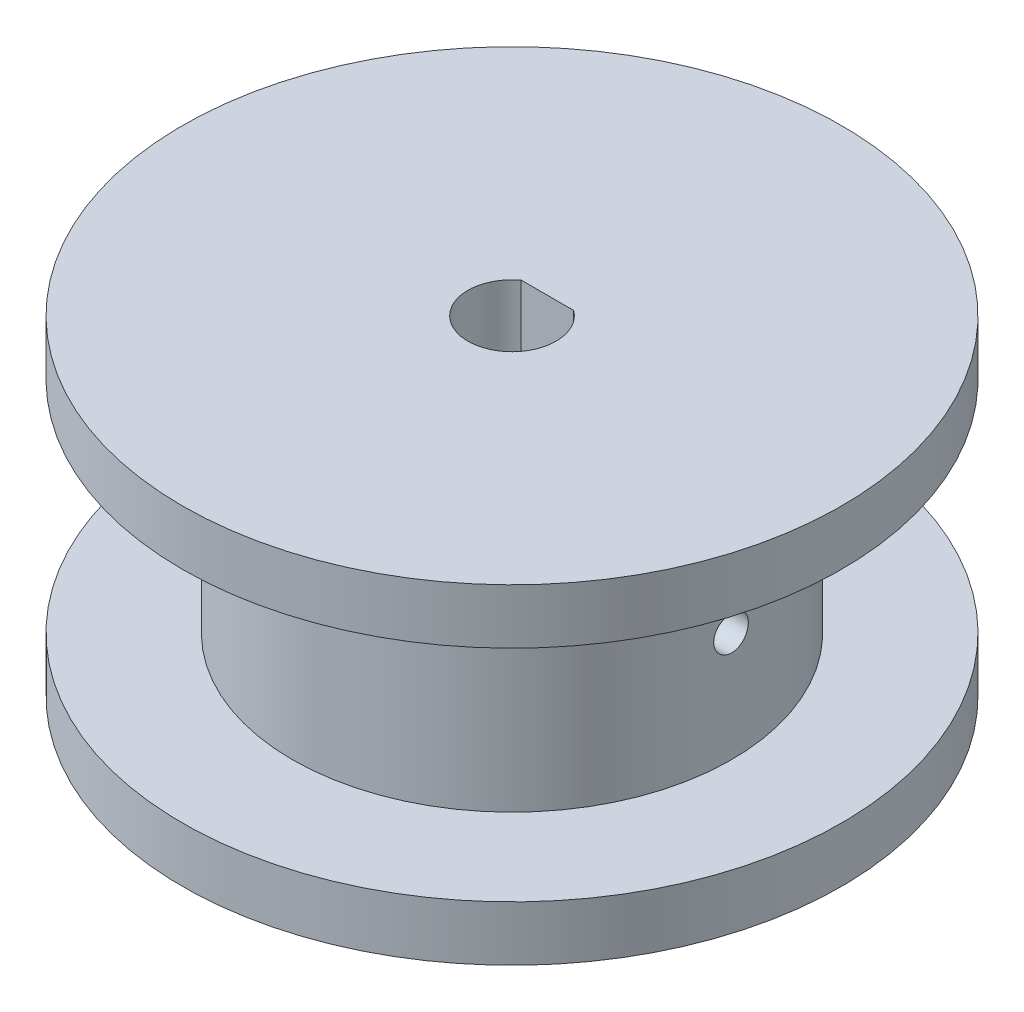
from build123d import *

# Parameters (mm, degrees)
SKETCH1_R               = 12.7
BOSS_EXTRUDE1_DEPTH     = 12.7
BOSS_EXTRUDE2_START     = 3.175
SKETCH2_R               = 19.05
BOSS_EXTRUDE2_DEPTH     = 3.175
BOSS_EXTRUDE3_START     = 6.35
SKETCH3_R               = 5.725
BOSS_EXTRUDE3_DEPTH     = 6.35
CUT_EXTRUDE1_DEPTH      = 32.135229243
CUT_EXTRUDE1_DEPTH_BACK = 32.135229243
SKETCH4_R               = 1.375
SKETCH5_R               = 19.05
BOSS_EXTRUDE4_DEPTH     = 3.175
CUT_EXTRUDE3_DEPTH      = 32.270123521
CUT_EXTRUDE3_DEPTH_BACK = 32.270123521
SKETCH7_R               = 1


with BuildPart() as part:
    # Sketch1 → Boss-Extrude1 (new body)
    with BuildSketch(Plane(origin=(0, 0, 0), x_dir=(1, 0, 0), z_dir=(0, 1, 0))):
        with Locations(Location((0, 0, 0), (0, 0, 270))):
            Circle(SKETCH1_R)
        with BuildLine():
            Line((1.516575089, 2.05), (-1.516575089, 2.05))
            ThreePointArc((-1.516575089, 2.05), (0, -2.55), (1.516575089, 2.05))
        make_face(mode=Mode.SUBTRACT)
    extrude(amount=BOSS_EXTRUDE1_DEPTH)

    # Sketch2 → Boss-Extrude2 (add)
    with BuildSketch(Plane.XZ.offset(BOSS_EXTRUDE2_START)):
        with Locations(Location((0, 0, 0), (0, 0, 270))):
            Circle(SKETCH2_R)
        with BuildLine():
            Line((1.516575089, -2.05), (-1.516575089, -2.05))
            ThreePointArc((-1.516575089, -2.05), (0, 2.55), (1.516575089, -2.05))
        make_face(mode=Mode.SUBTRACT)
    extrude(amount=-BOSS_EXTRUDE2_DEPTH)

    # Sketch3 → Boss-Extrude3 (add)
    with BuildSketch(Plane.XZ.offset(3.175).offset(BOSS_EXTRUDE3_START)):
        with Locations(Location((0, 0, 0), (0, 0, 270))):
            Circle(SKETCH3_R)
        with BuildLine():
            Line((-1.516575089, -2.05), (1.516575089, -2.05))
            ThreePointArc((1.516575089, -2.05), (0, 2.55), (-1.516575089, -2.05))
        make_face(mode=Mode.SUBTRACT)
    extrude(amount=-BOSS_EXTRUDE3_DEPTH)

    # Sketch4 → Cut-Extrude1 (cut, two sides: drawn at the far end of the back side and taken through both)
    with BuildSketch(Plane.XY.offset(-2.05).offset(-CUT_EXTRUDE1_DEPTH_BACK)):
        with Locations((0, -6.35)):
            Circle(SKETCH4_R)
    extrude(amount=CUT_EXTRUDE1_DEPTH + CUT_EXTRUDE1_DEPTH_BACK, mode=Mode.SUBTRACT)

    # Sketch5 → Boss-Extrude4 (add)
    with BuildSketch(Plane(origin=(0, 12.7, 0), x_dir=(1, 0, 0), z_dir=(0, 1, 0))):
        with Locations(Location((0, 0, 0), (0, 0, 90))):
            Circle(SKETCH5_R)
        with BuildLine():
            Line((1.516575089, 2.05), (-1.516575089, 2.05))
            ThreePointArc((-1.516575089, 2.05), (0, -2.55), (1.516575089, 2.05))
        make_face(mode=Mode.SUBTRACT)
    extrude(amount=BOSS_EXTRUDE4_DEPTH)

    # Sketch7 → Cut-Extrude3 (cut, two sides: drawn at the far end of the back side and taken through both)
    with BuildSketch(Plane(origin=(0, 0, 0), x_dir=(0, 0, -1), z_dir=(1, 0, 0)).offset(-CUT_EXTRUDE3_DEPTH_BACK)):
        with Locations((0, 6.35)):
            Circle(SKETCH7_R)
    extrude(amount=CUT_EXTRUDE3_DEPTH + CUT_EXTRUDE3_DEPTH_BACK, mode=Mode.SUBTRACT)


solid = part.part
